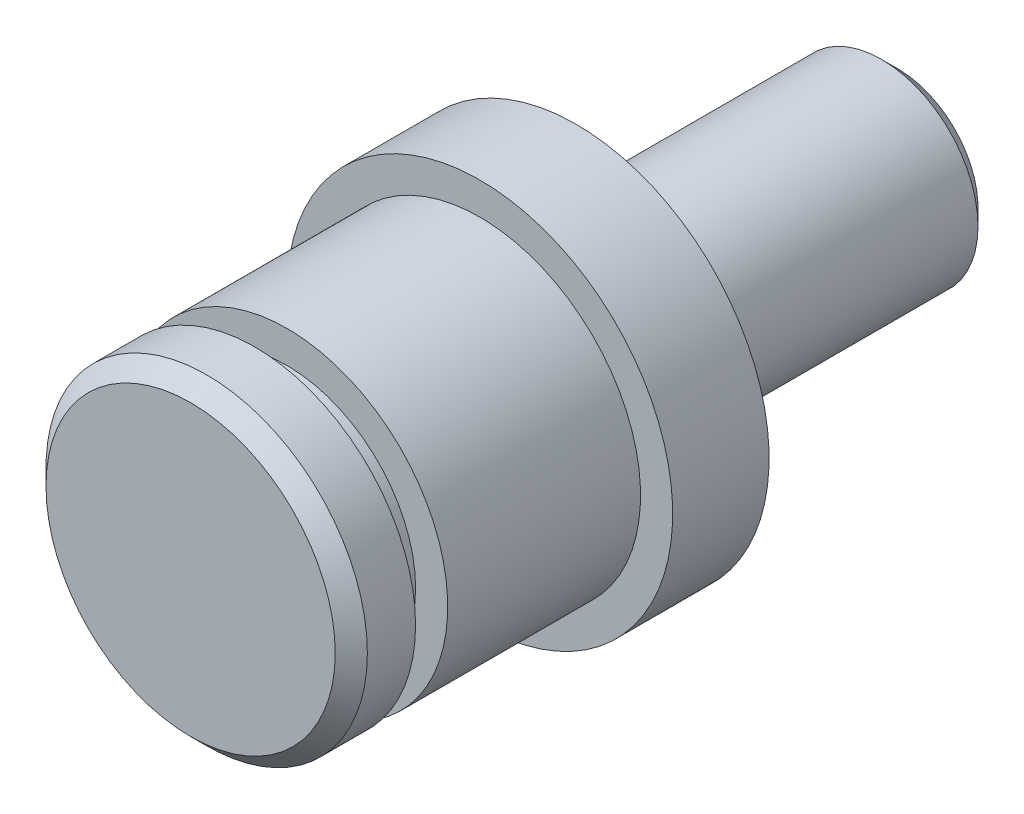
ISO-10303-21;
HEADER;
FILE_DESCRIPTION(('STEP AP214'),'2;1');
FILE_NAME('part.step','',(''),(''),'','','');
FILE_SCHEMA(('AUTOMOTIVE_DESIGN { 1 0 10303 214 1 1 1 1 }'));
ENDSEC;
DATA;
#1=APPLICATION_CONTEXT('core data for automotive mechanical design processes');
#2=APPLICATION_PROTOCOL_DEFINITION('international standard','automotive_design',2000,#1);
#3=PRODUCT_CONTEXT('',#1,'mechanical');
#4=PRODUCT('Part','Part','',(#3));
#5=PRODUCT_RELATED_PRODUCT_CATEGORY('part','',(#4));
#6=PRODUCT_DEFINITION_FORMATION('','',#4);
#7=PRODUCT_DEFINITION_CONTEXT('part definition',#1,'design');
#8=PRODUCT_DEFINITION('design','',#6,#7);
#9=PRODUCT_DEFINITION_SHAPE('','',#8);
#10=(LENGTH_UNIT() NAMED_UNIT(*) SI_UNIT(.MILLI.,.METRE.));
#11=(NAMED_UNIT(*) PLANE_ANGLE_UNIT() SI_UNIT($,.RADIAN.));
#12=(NAMED_UNIT(*) SI_UNIT($,.STERADIAN.) SOLID_ANGLE_UNIT());
#13=UNCERTAINTY_MEASURE_WITH_UNIT(LENGTH_MEASURE(1.E-05),#10,'distance_accuracy_value','');
#14=(GEOMETRIC_REPRESENTATION_CONTEXT(3) GLOBAL_UNCERTAINTY_ASSIGNED_CONTEXT((#13)) GLOBAL_UNIT_ASSIGNED_CONTEXT((#10,
#11,#12)) REPRESENTATION_CONTEXT('',''));
#15=CARTESIAN_POINT('',(0.,0.,0.));
#16=DIRECTION('',(0.,0.,1.));
#17=DIRECTION('',(1.,0.,0.));
#18=AXIS2_PLACEMENT_3D('',#15,#16,#17);
#19=CARTESIAN_POINT('',(0.,0.,2.));
#20=DIRECTION('',(0.,0.,-1.));
#21=DIRECTION('',(-1.,0.,0.));
#22=AXIS2_PLACEMENT_3D('',#19,#20,#21);
#23=CYLINDRICAL_SURFACE('',#22,5.);
#24=CARTESIAN_POINT('',(0.,0.,1.5));
#25=DIRECTION('',(0.,0.,1.));
#26=DIRECTION('',(1.,0.,0.));
#27=AXIS2_PLACEMENT_3D('',#24,#25,#26);
#28=CIRCLE('',#27,5.);
#29=CARTESIAN_POINT('',(5.,0.,1.5));
#30=VERTEX_POINT('',#29);
#31=EDGE_CURVE('E44',#30,#30,#28,.F.);
#32=ORIENTED_EDGE('',*,*,#31,.T.);
#33=EDGE_LOOP('',(#32));
#34=FACE_BOUND('',#33,.T.);
#35=CARTESIAN_POINT('',(0.,0.,0.));
#36=DIRECTION('',(0.,0.,1.));
#37=DIRECTION('',(1.,0.,0.));
#38=AXIS2_PLACEMENT_3D('',#35,#36,#37);
#39=CIRCLE('',#38,5.);
#40=CARTESIAN_POINT('',(5.,0.,0.));
#41=VERTEX_POINT('',#40);
#42=EDGE_CURVE('E55',#41,#41,#39,.T.);
#43=ORIENTED_EDGE('',*,*,#42,.T.);
#44=EDGE_LOOP('',(#43));
#45=FACE_BOUND('',#44,.T.);
#46=ADVANCED_FACE('F32',(#34,#45),#23,.T.);
#47=CARTESIAN_POINT('',(0.,0.,2.));
#48=DIRECTION('',(0.,0.,1.));
#49=DIRECTION('',(1.,0.,0.));
#50=AXIS2_PLACEMENT_3D('',#47,#48,#49);
#51=PLANE('',#50);
#52=CARTESIAN_POINT('',(0.,0.,2.));
#53=DIRECTION('',(0.,0.,1.));
#54=DIRECTION('',(1.,0.,0.));
#55=AXIS2_PLACEMENT_3D('',#52,#53,#54);
#56=CIRCLE('',#55,4.5);
#57=CARTESIAN_POINT('',(4.5,0.,2.));
#58=VERTEX_POINT('',#57);
#59=EDGE_CURVE('E49',#58,#58,#56,.T.);
#60=ORIENTED_EDGE('',*,*,#59,.T.);
#61=EDGE_LOOP('',(#60));
#62=FACE_BOUND('',#61,.T.);
#63=ADVANCED_FACE('F97',(#62),#51,.T.);
#64=CARTESIAN_POINT('',(0.,0.,0.));
#65=DIRECTION('',(0.,0.,1.));
#66=DIRECTION('',(1.,0.,0.));
#67=AXIS2_PLACEMENT_3D('',#64,#65,#66);
#68=PLANE('',#67);
#69=CARTESIAN_POINT('',(0.,0.,0.));
#70=DIRECTION('',(0.,0.,1.));
#71=DIRECTION('',(1.,0.,0.));
#72=AXIS2_PLACEMENT_3D('',#69,#70,#71);
#73=CIRCLE('',#72,4.);
#74=CARTESIAN_POINT('',(4.,0.,0.));
#75=VERTEX_POINT('',#74);
#76=EDGE_CURVE('E52',#75,#75,#73,.F.);
#77=ORIENTED_EDGE('',*,*,#76,.F.);
#78=EDGE_LOOP('',(#77));
#79=FACE_BOUND('',#78,.T.);
#80=ORIENTED_EDGE('',*,*,#42,.F.);
#81=EDGE_LOOP('',(#80));
#82=FACE_BOUND('',#81,.T.);
#83=ADVANCED_FACE('F103',(#79,#82),#68,.F.);
#84=CARTESIAN_POINT('',(0.,0.,-1.));
#85=DIRECTION('',(0.,0.,1.));
#86=DIRECTION('',(1.,0.,0.));
#87=AXIS2_PLACEMENT_3D('',#84,#85,#86);
#88=CYLINDRICAL_SURFACE('',#87,4.);
#89=CARTESIAN_POINT('',(0.,0.,-1.));
#90=DIRECTION('',(0.,0.,-1.));
#91=DIRECTION('',(-1.,0.,0.));
#92=AXIS2_PLACEMENT_3D('',#89,#90,#91);
#93=CIRCLE('',#92,4.);
#94=CARTESIAN_POINT('',(-4.,0.,-1.));
#95=VERTEX_POINT('',#94);
#96=EDGE_CURVE('E58',#95,#95,#93,.T.);
#97=ORIENTED_EDGE('',*,*,#96,.F.);
#98=EDGE_LOOP('',(#97));
#99=FACE_BOUND('',#98,.T.);
#100=ORIENTED_EDGE('',*,*,#76,.T.);
#101=EDGE_LOOP('',(#100));
#102=FACE_BOUND('',#101,.T.);
#103=ADVANCED_FACE('F109',(#99,#102),#88,.T.);
#104=CARTESIAN_POINT('',(0.,0.,-7.));
#105=DIRECTION('',(0.,0.,1.));
#106=DIRECTION('',(1.,0.,0.));
#107=AXIS2_PLACEMENT_3D('',#104,#105,#106);
#108=CYLINDRICAL_SURFACE('',#107,5.);
#109=CARTESIAN_POINT('',(0.,0.,-7.));
#110=DIRECTION('',(0.,0.,-1.));
#111=DIRECTION('',(-1.,0.,0.));
#112=AXIS2_PLACEMENT_3D('',#109,#110,#111);
#113=CIRCLE('',#112,5.);
#114=CARTESIAN_POINT('',(-5.,0.,-7.));
#115=VERTEX_POINT('',#114);
#116=EDGE_CURVE('E61',#115,#115,#113,.T.);
#117=ORIENTED_EDGE('',*,*,#116,.F.);
#118=EDGE_LOOP('',(#117));
#119=FACE_BOUND('',#118,.T.);
#120=CARTESIAN_POINT('',(0.,0.,-1.));
#121=DIRECTION('',(0.,0.,-1.));
#122=DIRECTION('',(-1.,0.,0.));
#123=AXIS2_PLACEMENT_3D('',#120,#121,#122);
#124=CIRCLE('',#123,5.);
#125=CARTESIAN_POINT('',(-5.,0.,-1.));
#126=VERTEX_POINT('',#125);
#127=EDGE_CURVE('E62',#126,#126,#124,.T.);
#128=ORIENTED_EDGE('',*,*,#127,.T.);
#129=EDGE_LOOP('',(#128));
#130=FACE_BOUND('',#129,.T.);
#131=ADVANCED_FACE('F114',(#119,#130),#108,.T.);
#132=CARTESIAN_POINT('',(0.,0.,-1.));
#133=DIRECTION('',(0.,0.,-1.));
#134=DIRECTION('',(-1.,0.,0.));
#135=AXIS2_PLACEMENT_3D('',#132,#133,#134);
#136=PLANE('',#135);
#137=ORIENTED_EDGE('',*,*,#96,.T.);
#138=EDGE_LOOP('',(#137));
#139=FACE_BOUND('',#138,.T.);
#140=ORIENTED_EDGE('',*,*,#127,.F.);
#141=EDGE_LOOP('',(#140));
#142=FACE_BOUND('',#141,.T.);
#143=ADVANCED_FACE('F118',(#139,#142),#136,.F.);
#144=CARTESIAN_POINT('',(0.,0.,-10.));
#145=DIRECTION('',(0.,0.,1.));
#146=DIRECTION('',(1.,0.,0.));
#147=AXIS2_PLACEMENT_3D('',#144,#145,#146);
#148=CYLINDRICAL_SURFACE('',#147,6.);
#149=CARTESIAN_POINT('',(0.,0.,-10.));
#150=DIRECTION('',(0.,0.,-1.));
#151=DIRECTION('',(-1.,0.,0.));
#152=AXIS2_PLACEMENT_3D('',#149,#150,#151);
#153=CIRCLE('',#152,6.);
#154=CARTESIAN_POINT('',(-6.,0.,-10.));
#155=VERTEX_POINT('',#154);
#156=EDGE_CURVE('E65',#155,#155,#153,.T.);
#157=ORIENTED_EDGE('',*,*,#156,.F.);
#158=EDGE_LOOP('',(#157));
#159=FACE_BOUND('',#158,.T.);
#160=CARTESIAN_POINT('',(0.,0.,-7.));
#161=DIRECTION('',(0.,0.,-1.));
#162=DIRECTION('',(-1.,0.,0.));
#163=AXIS2_PLACEMENT_3D('',#160,#161,#162);
#164=CIRCLE('',#163,6.);
#165=CARTESIAN_POINT('',(-6.,0.,-7.));
#166=VERTEX_POINT('',#165);
#167=EDGE_CURVE('E68',#166,#166,#164,.T.);
#168=ORIENTED_EDGE('',*,*,#167,.T.);
#169=EDGE_LOOP('',(#168));
#170=FACE_BOUND('',#169,.T.);
#171=ADVANCED_FACE('F122',(#159,#170),#148,.T.);
#172=CARTESIAN_POINT('',(0.,0.,-10.));
#173=DIRECTION('',(0.,0.,-1.));
#174=DIRECTION('',(-1.,0.,0.));
#175=AXIS2_PLACEMENT_3D('',#172,#173,#174);
#176=PLANE('',#175);
#177=CARTESIAN_POINT('',(0.,0.,-10.));
#178=DIRECTION('',(0.,0.,-1.));
#179=DIRECTION('',(-1.,0.,0.));
#180=AXIS2_PLACEMENT_3D('',#177,#178,#179);
#181=CIRCLE('',#180,3.);
#182=CARTESIAN_POINT('',(-3.,0.,-10.));
#183=VERTEX_POINT('',#182);
#184=EDGE_CURVE('E71',#183,#183,#181,.F.);
#185=ORIENTED_EDGE('',*,*,#184,.T.);
#186=EDGE_LOOP('',(#185));
#187=FACE_BOUND('',#186,.T.);
#188=ORIENTED_EDGE('',*,*,#156,.T.);
#189=EDGE_LOOP('',(#188));
#190=FACE_BOUND('',#189,.T.);
#191=ADVANCED_FACE('F126',(#187,#190),#176,.T.);
#192=CARTESIAN_POINT('',(0.,0.,-7.));
#193=DIRECTION('',(0.,0.,-1.));
#194=DIRECTION('',(-1.,0.,0.));
#195=AXIS2_PLACEMENT_3D('',#192,#193,#194);
#196=PLANE('',#195);
#197=ORIENTED_EDGE('',*,*,#116,.T.);
#198=EDGE_LOOP('',(#197));
#199=FACE_BOUND('',#198,.T.);
#200=ORIENTED_EDGE('',*,*,#167,.F.);
#201=EDGE_LOOP('',(#200));
#202=FACE_BOUND('',#201,.T.);
#203=ADVANCED_FACE('F94',(#199,#202),#196,.F.);
#204=CARTESIAN_POINT('',(0.,0.,2.));
#205=DIRECTION('',(0.,0.,-1.));
#206=DIRECTION('',(-1.,0.,0.));
#207=AXIS2_PLACEMENT_3D('',#204,#205,#206);
#208=CONICAL_SURFACE('',#207,4.5,0.785398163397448);
#209=ORIENTED_EDGE('',*,*,#31,.F.);
#210=EDGE_LOOP('',(#209));
#211=FACE_BOUND('',#210,.T.);
#212=ORIENTED_EDGE('',*,*,#59,.F.);
#213=EDGE_LOOP('',(#212));
#214=FACE_BOUND('',#213,.T.);
#215=ADVANCED_FACE('F86',(#211,#214),#208,.T.);
#216=CARTESIAN_POINT('',(0.,0.,-10.5));
#217=DIRECTION('',(0.,0.,1.));
#218=DIRECTION('',(1.,0.,0.));
#219=AXIS2_PLACEMENT_3D('',#216,#217,#218);
#220=TOROIDAL_SURFACE('',#219,3.,0.5);
#221=CARTESIAN_POINT('',(0.,0.,-11.));
#222=DIRECTION('',(0.,0.,1.));
#223=DIRECTION('',(1.,0.,0.));
#224=AXIS2_PLACEMENT_3D('',#221,#222,#223);
#225=CIRCLE('',#224,3.);
#226=CARTESIAN_POINT('',(3.,0.,-11.));
#227=VERTEX_POINT('',#226);
#228=EDGE_CURVE('E36',#227,#227,#225,.F.);
#229=ORIENTED_EDGE('',*,*,#228,.F.);
#230=EDGE_LOOP('',(#229));
#231=FACE_BOUND('',#230,.T.);
#232=ORIENTED_EDGE('',*,*,#184,.F.);
#233=EDGE_LOOP('',(#232));
#234=FACE_BOUND('',#233,.T.);
#235=ADVANCED_FACE('F82',(#231,#234),#220,.F.);
#236=CARTESIAN_POINT('',(0.,0.,-20.));
#237=DIRECTION('',(0.,0.,-1.));
#238=DIRECTION('',(-1.,0.,0.));
#239=AXIS2_PLACEMENT_3D('',#236,#237,#238);
#240=PLANE('',#239);
#241=CARTESIAN_POINT('',(0.,0.,-20.));
#242=DIRECTION('',(0.,0.,-1.));
#243=DIRECTION('',(-1.,0.,0.));
#244=AXIS2_PLACEMENT_3D('',#241,#242,#243);
#245=CIRCLE('',#244,2.5);
#246=CARTESIAN_POINT('',(-2.5,0.,-20.));
#247=VERTEX_POINT('',#246);
#248=EDGE_CURVE('E40',#247,#247,#245,.T.);
#249=ORIENTED_EDGE('',*,*,#248,.T.);
#250=EDGE_LOOP('',(#249));
#251=FACE_BOUND('',#250,.T.);
#252=ADVANCED_FACE('F85',(#251),#240,.T.);
#253=CARTESIAN_POINT('',(0.,0.,-20.));
#254=DIRECTION('',(0.,0.,1.));
#255=DIRECTION('',(1.,0.,0.));
#256=AXIS2_PLACEMENT_3D('',#253,#254,#255);
#257=CONICAL_SURFACE('',#256,2.5,0.785398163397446);
#258=CARTESIAN_POINT('',(0.,0.,-19.5));
#259=DIRECTION('',(0.,0.,-1.));
#260=DIRECTION('',(-1.,0.,0.));
#261=AXIS2_PLACEMENT_3D('',#258,#259,#260);
#262=CIRCLE('',#261,3.);
#263=CARTESIAN_POINT('',(-3.,0.,-19.5));
#264=VERTEX_POINT('',#263);
#265=EDGE_CURVE('E10',#264,#264,#262,.F.);
#266=ORIENTED_EDGE('',*,*,#265,.F.);
#267=EDGE_LOOP('',(#266));
#268=FACE_BOUND('',#267,.T.);
#269=ORIENTED_EDGE('',*,*,#248,.F.);
#270=EDGE_LOOP('',(#269));
#271=FACE_BOUND('',#270,.T.);
#272=ADVANCED_FACE('F34',(#268,#271),#257,.T.);
#273=CARTESIAN_POINT('',(0.,0.,-20.));
#274=DIRECTION('',(0.,0.,1.));
#275=DIRECTION('',(1.,0.,0.));
#276=AXIS2_PLACEMENT_3D('',#273,#274,#275);
#277=CYLINDRICAL_SURFACE('',#276,3.);
#278=ORIENTED_EDGE('',*,*,#228,.T.);
#279=EDGE_LOOP('',(#278));
#280=FACE_BOUND('',#279,.T.);
#281=ORIENTED_EDGE('',*,*,#265,.T.);
#282=EDGE_LOOP('',(#281));
#283=FACE_BOUND('',#282,.T.);
#284=ADVANCED_FACE('F80',(#280,#283),#277,.T.);
#285=CLOSED_SHELL('',(#46,#63,#83,#103,#131,#143,#171,#191,#203,#215,#235,#252,#272,#284));
#286=MANIFOLD_SOLID_BREP('B2',#285);
#287=ADVANCED_BREP_SHAPE_REPRESENTATION('',(#18,#286),#14);
#288=SHAPE_DEFINITION_REPRESENTATION(#9,#287);
ENDSEC;
END-ISO-10303-21;
